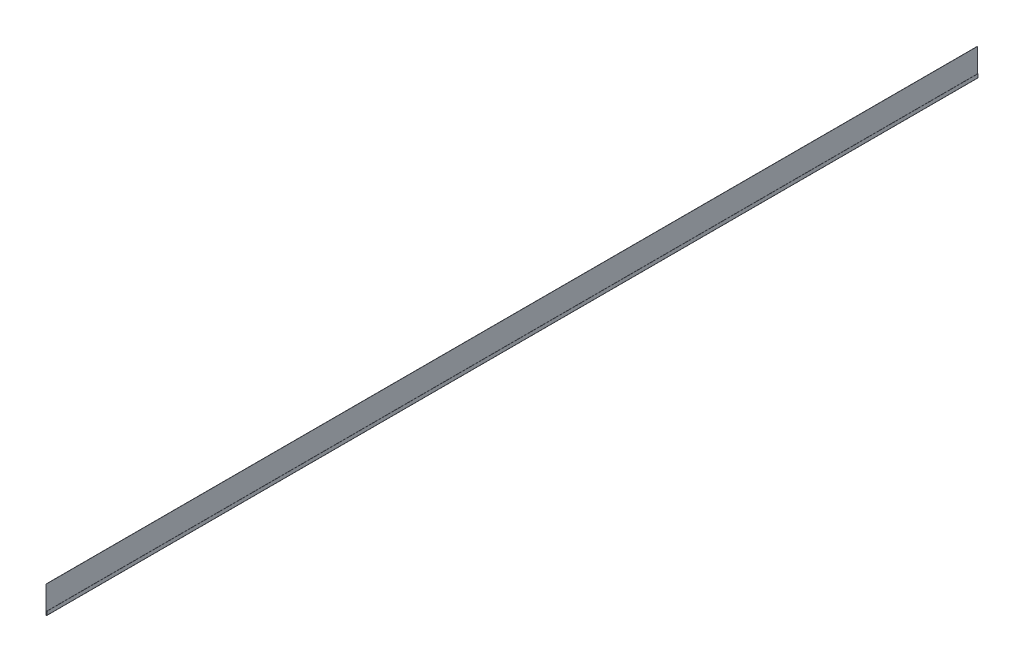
ISO-10303-21;
HEADER;
FILE_DESCRIPTION(('STEP AP214'),'2;1');
FILE_NAME('part.step','',(''),(''),'','','');
FILE_SCHEMA(('AUTOMOTIVE_DESIGN { 1 0 10303 214 1 1 1 1 }'));
ENDSEC;
DATA;
#1=APPLICATION_CONTEXT('core data for automotive mechanical design processes');
#2=APPLICATION_PROTOCOL_DEFINITION('international standard','automotive_design',2000,#1);
#3=PRODUCT_CONTEXT('',#1,'mechanical');
#4=PRODUCT('Part','Part','',(#3));
#5=PRODUCT_RELATED_PRODUCT_CATEGORY('part','',(#4));
#6=PRODUCT_DEFINITION_FORMATION('','',#4);
#7=PRODUCT_DEFINITION_CONTEXT('part definition',#1,'design');
#8=PRODUCT_DEFINITION('design','',#6,#7);
#9=PRODUCT_DEFINITION_SHAPE('','',#8);
#10=(LENGTH_UNIT() NAMED_UNIT(*) SI_UNIT(.MILLI.,.METRE.));
#11=(NAMED_UNIT(*) PLANE_ANGLE_UNIT() SI_UNIT($,.RADIAN.));
#12=(NAMED_UNIT(*) SI_UNIT($,.STERADIAN.) SOLID_ANGLE_UNIT());
#13=UNCERTAINTY_MEASURE_WITH_UNIT(LENGTH_MEASURE(1.E-05),#10,'distance_accuracy_value','');
#14=(GEOMETRIC_REPRESENTATION_CONTEXT(3) GLOBAL_UNCERTAINTY_ASSIGNED_CONTEXT((#13)) GLOBAL_UNIT_ASSIGNED_CONTEXT((#10,
#11,#12)) REPRESENTATION_CONTEXT('',''));
#15=CARTESIAN_POINT('',(0.,0.,0.));
#16=DIRECTION('',(0.,0.,1.));
#17=DIRECTION('',(1.,0.,0.));
#18=AXIS2_PLACEMENT_3D('',#15,#16,#17);
#19=CARTESIAN_POINT('',(2.54,1.27,3048.));
#20=DIRECTION('',(-1.,0.,0.));
#21=DIRECTION('',(0.,0.,1.));
#22=AXIS2_PLACEMENT_3D('',#19,#20,#21);
#23=PLANE('',#22);
#24=DIRECTION('',(0.,1.,0.));
#25=VECTOR('',#24,1.);
#26=CARTESIAN_POINT('',(2.54,1.27,0.));
#27=LINE('',#26,#25);
#28=CARTESIAN_POINT('',(2.54,1.27,0.));
#29=VERTEX_POINT('',#28);
#30=CARTESIAN_POINT('',(2.54,12.7,0.));
#31=VERTEX_POINT('',#30);
#32=EDGE_CURVE('E142',#29,#31,#27,.T.);
#33=ORIENTED_EDGE('',*,*,#32,.T.);
#34=DIRECTION('',(0.,0.,-1.));
#35=VECTOR('',#34,1.);
#36=CARTESIAN_POINT('',(2.54,12.7,3048.));
#37=LINE('',#36,#35);
#38=CARTESIAN_POINT('',(2.54,12.7,3048.));
#39=VERTEX_POINT('',#38);
#40=EDGE_CURVE('E13',#39,#31,#37,.T.);
#41=ORIENTED_EDGE('',*,*,#40,.F.);
#42=DIRECTION('',(0.,1.,0.));
#43=VECTOR('',#42,1.);
#44=CARTESIAN_POINT('',(2.54,1.27,3048.));
#45=LINE('',#44,#43);
#46=CARTESIAN_POINT('',(2.54,1.27,3048.));
#47=VERTEX_POINT('',#46);
#48=EDGE_CURVE('E100',#47,#39,#45,.T.);
#49=ORIENTED_EDGE('',*,*,#48,.F.);
#50=DIRECTION('',(0.,0.,-1.));
#51=VECTOR('',#50,1.);
#52=CARTESIAN_POINT('',(2.54,1.27,3048.));
#53=LINE('',#52,#51);
#54=EDGE_CURVE('E141',#47,#29,#53,.T.);
#55=ORIENTED_EDGE('',*,*,#54,.T.);
#56=EDGE_LOOP('',(#33,#41,#49,#55));
#57=FACE_BOUND('',#56,.T.);
#58=ADVANCED_FACE('F45',(#57),#23,.F.);
#59=CARTESIAN_POINT('',(2.032,12.7,3048.));
#60=DIRECTION('',(0.,1.,0.));
#61=DIRECTION('',(0.,0.,1.));
#62=AXIS2_PLACEMENT_3D('',#59,#60,#61);
#63=PLANE('',#62);
#64=DIRECTION('',(1.,0.,0.));
#65=VECTOR('',#64,1.);
#66=CARTESIAN_POINT('',(2.032,12.7,0.));
#67=LINE('',#66,#65);
#68=CARTESIAN_POINT('',(2.032,12.7,0.));
#69=VERTEX_POINT('',#68);
#70=EDGE_CURVE('E145',#69,#31,#67,.T.);
#71=ORIENTED_EDGE('',*,*,#70,.F.);
#72=DIRECTION('',(0.,0.,-1.));
#73=VECTOR('',#72,1.);
#74=CARTESIAN_POINT('',(2.032,12.7,3048.));
#75=LINE('',#74,#73);
#76=CARTESIAN_POINT('',(2.032,12.7,3048.));
#77=VERTEX_POINT('',#76);
#78=EDGE_CURVE('E53',#77,#69,#75,.T.);
#79=ORIENTED_EDGE('',*,*,#78,.F.);
#80=DIRECTION('',(1.,0.,0.));
#81=VECTOR('',#80,1.);
#82=CARTESIAN_POINT('',(2.032,12.7,3048.));
#83=LINE('',#82,#81);
#84=EDGE_CURVE('E184',#77,#39,#83,.T.);
#85=ORIENTED_EDGE('',*,*,#84,.T.);
#86=ORIENTED_EDGE('',*,*,#40,.T.);
#87=EDGE_LOOP('',(#71,#79,#85,#86));
#88=FACE_BOUND('',#87,.T.);
#89=ADVANCED_FACE('F175',(#88),#63,.T.);
#90=CARTESIAN_POINT('',(2.032,1.27,3048.));
#91=DIRECTION('',(-1.,0.,0.));
#92=DIRECTION('',(0.,0.,1.));
#93=AXIS2_PLACEMENT_3D('',#90,#91,#92);
#94=PLANE('',#93);
#95=DIRECTION('',(0.,1.,0.));
#96=VECTOR('',#95,1.);
#97=CARTESIAN_POINT('',(2.032,1.27,0.));
#98=LINE('',#97,#96);
#99=CARTESIAN_POINT('',(2.032,1.27,0.));
#100=VERTEX_POINT('',#99);
#101=EDGE_CURVE('E148',#100,#69,#98,.T.);
#102=ORIENTED_EDGE('',*,*,#101,.F.);
#103=DIRECTION('',(0.,0.,-1.));
#104=VECTOR('',#103,1.);
#105=CARTESIAN_POINT('',(2.032,1.27,3048.));
#106=LINE('',#105,#104);
#107=CARTESIAN_POINT('',(2.032,1.27,3048.));
#108=VERTEX_POINT('',#107);
#109=EDGE_CURVE('E165',#108,#100,#106,.T.);
#110=ORIENTED_EDGE('',*,*,#109,.F.);
#111=DIRECTION('',(0.,1.,0.));
#112=VECTOR('',#111,1.);
#113=CARTESIAN_POINT('',(2.032,1.27,3048.));
#114=LINE('',#113,#112);
#115=EDGE_CURVE('E172',#108,#77,#114,.T.);
#116=ORIENTED_EDGE('',*,*,#115,.T.);
#117=ORIENTED_EDGE('',*,*,#78,.T.);
#118=EDGE_LOOP('',(#102,#110,#116,#117));
#119=FACE_BOUND('',#118,.T.);
#120=ADVANCED_FACE('F170',(#119),#94,.T.);
#121=CARTESIAN_POINT('',(1.27,1.27,3048.));
#122=DIRECTION('',(0.,0.,-1.));
#123=DIRECTION('',(-1.,0.,0.));
#124=AXIS2_PLACEMENT_3D('',#121,#122,#123);
#125=CYLINDRICAL_SURFACE('',#124,0.762);
#126=CARTESIAN_POINT('',(1.27,1.27,0.));
#127=DIRECTION('',(0.,0.,1.));
#128=DIRECTION('',(1.,0.,0.));
#129=AXIS2_PLACEMENT_3D('',#126,#127,#128);
#130=CIRCLE('',#129,0.762);
#131=CARTESIAN_POINT('',(0.508,1.27,0.));
#132=VERTEX_POINT('',#131);
#133=EDGE_CURVE('E151',#132,#100,#130,.T.);
#134=ORIENTED_EDGE('',*,*,#133,.F.);
#135=DIRECTION('',(0.,0.,-1.));
#136=VECTOR('',#135,1.);
#137=CARTESIAN_POINT('',(0.508,1.27,3048.));
#138=LINE('',#137,#136);
#139=CARTESIAN_POINT('',(0.508,1.27,3048.));
#140=VERTEX_POINT('',#139);
#141=EDGE_CURVE('E163',#140,#132,#138,.T.);
#142=ORIENTED_EDGE('',*,*,#141,.F.);
#143=CARTESIAN_POINT('',(1.27,1.27,3048.));
#144=DIRECTION('',(0.,0.,1.));
#145=DIRECTION('',(1.,0.,0.));
#146=AXIS2_PLACEMENT_3D('',#143,#144,#145);
#147=CIRCLE('',#146,0.762);
#148=EDGE_CURVE('E136',#140,#108,#147,.T.);
#149=ORIENTED_EDGE('',*,*,#148,.T.);
#150=ORIENTED_EDGE('',*,*,#109,.T.);
#151=EDGE_LOOP('',(#134,#142,#149,#150));
#152=FACE_BOUND('',#151,.T.);
#153=ADVANCED_FACE('F182',(#152),#125,.F.);
#154=CARTESIAN_POINT('',(0.508,1.27,3048.));
#155=DIRECTION('',(1.,0.,0.));
#156=DIRECTION('',(0.,0.,-1.));
#157=AXIS2_PLACEMENT_3D('',#154,#155,#156);
#158=PLANE('',#157);
#159=DIRECTION('',(0.,1.,0.));
#160=VECTOR('',#159,1.);
#161=CARTESIAN_POINT('',(0.508,1.27,0.));
#162=LINE('',#161,#160);
#163=CARTESIAN_POINT('',(0.508,88.9,0.));
#164=VERTEX_POINT('',#163);
#165=EDGE_CURVE('E154',#164,#132,#162,.F.);
#166=ORIENTED_EDGE('',*,*,#165,.F.);
#167=DIRECTION('',(0.,0.,-1.));
#168=VECTOR('',#167,1.);
#169=CARTESIAN_POINT('',(0.508,88.9,3048.));
#170=LINE('',#169,#168);
#171=CARTESIAN_POINT('',(0.508,88.9,3048.));
#172=VERTEX_POINT('',#171);
#173=EDGE_CURVE('E124',#172,#164,#170,.T.);
#174=ORIENTED_EDGE('',*,*,#173,.F.);
#175=DIRECTION('',(0.,1.,0.));
#176=VECTOR('',#175,1.);
#177=CARTESIAN_POINT('',(0.508,1.27,3048.));
#178=LINE('',#177,#176);
#179=EDGE_CURVE('E134',#172,#140,#178,.F.);
#180=ORIENTED_EDGE('',*,*,#179,.T.);
#181=ORIENTED_EDGE('',*,*,#141,.T.);
#182=EDGE_LOOP('',(#166,#174,#180,#181));
#183=FACE_BOUND('',#182,.T.);
#184=ADVANCED_FACE('F189',(#183),#158,.T.);
#185=CARTESIAN_POINT('',(0.,88.9,3048.));
#186=DIRECTION('',(0.,1.,0.));
#187=DIRECTION('',(0.,0.,1.));
#188=AXIS2_PLACEMENT_3D('',#185,#186,#187);
#189=PLANE('',#188);
#190=DIRECTION('',(1.,0.,0.));
#191=VECTOR('',#190,1.);
#192=CARTESIAN_POINT('',(0.,88.9,0.));
#193=LINE('',#192,#191);
#194=CARTESIAN_POINT('',(0.,88.9,0.));
#195=VERTEX_POINT('',#194);
#196=EDGE_CURVE('E123',#195,#164,#193,.T.);
#197=ORIENTED_EDGE('',*,*,#196,.F.);
#198=DIRECTION('',(0.,0.,-1.));
#199=VECTOR('',#198,1.);
#200=CARTESIAN_POINT('',(0.,88.9,3048.));
#201=LINE('',#200,#199);
#202=CARTESIAN_POINT('',(0.,88.9,3048.));
#203=VERTEX_POINT('',#202);
#204=EDGE_CURVE('E117',#203,#195,#201,.T.);
#205=ORIENTED_EDGE('',*,*,#204,.F.);
#206=DIRECTION('',(1.,0.,0.));
#207=VECTOR('',#206,1.);
#208=CARTESIAN_POINT('',(0.,88.9,3048.));
#209=LINE('',#208,#207);
#210=EDGE_CURVE('E121',#203,#172,#209,.T.);
#211=ORIENTED_EDGE('',*,*,#210,.T.);
#212=ORIENTED_EDGE('',*,*,#173,.T.);
#213=EDGE_LOOP('',(#197,#205,#211,#212));
#214=FACE_BOUND('',#213,.T.);
#215=ADVANCED_FACE('F119',(#214),#189,.T.);
#216=CARTESIAN_POINT('',(0.,1.27,3048.));
#217=DIRECTION('',(1.,0.,0.));
#218=DIRECTION('',(0.,0.,-1.));
#219=AXIS2_PLACEMENT_3D('',#216,#217,#218);
#220=PLANE('',#219);
#221=DIRECTION('',(0.,-1.,0.));
#222=VECTOR('',#221,1.);
#223=CARTESIAN_POINT('',(0.,1.27,0.));
#224=LINE('',#223,#222);
#225=CARTESIAN_POINT('',(0.,1.27,0.));
#226=VERTEX_POINT('',#225);
#227=EDGE_CURVE('E88',#195,#226,#224,.T.);
#228=ORIENTED_EDGE('',*,*,#227,.T.);
#229=DIRECTION('',(0.,0.,-1.));
#230=VECTOR('',#229,1.);
#231=CARTESIAN_POINT('',(0.,1.27,3048.));
#232=LINE('',#231,#230);
#233=CARTESIAN_POINT('',(0.,1.27,3048.));
#234=VERTEX_POINT('',#233);
#235=EDGE_CURVE('E125',#234,#226,#232,.T.);
#236=ORIENTED_EDGE('',*,*,#235,.F.);
#237=DIRECTION('',(0.,-1.,0.));
#238=VECTOR('',#237,1.);
#239=CARTESIAN_POINT('',(0.,1.27,3048.));
#240=LINE('',#239,#238);
#241=EDGE_CURVE('E127',#203,#234,#240,.T.);
#242=ORIENTED_EDGE('',*,*,#241,.F.);
#243=ORIENTED_EDGE('',*,*,#204,.T.);
#244=EDGE_LOOP('',(#228,#236,#242,#243));
#245=FACE_BOUND('',#244,.T.);
#246=ADVANCED_FACE('F128',(#245),#220,.F.);
#247=CARTESIAN_POINT('',(1.27,1.27,3048.));
#248=DIRECTION('',(0.,0.,-1.));
#249=DIRECTION('',(-1.,0.,0.));
#250=AXIS2_PLACEMENT_3D('',#247,#248,#249);
#251=CYLINDRICAL_SURFACE('',#250,1.27);
#252=CARTESIAN_POINT('',(1.27,1.27,0.));
#253=DIRECTION('',(0.,0.,1.));
#254=DIRECTION('',(1.,0.,0.));
#255=AXIS2_PLACEMENT_3D('',#252,#253,#254);
#256=CIRCLE('',#255,1.27);
#257=EDGE_CURVE('E94',#226,#29,#256,.T.);
#258=ORIENTED_EDGE('',*,*,#257,.T.);
#259=ORIENTED_EDGE('',*,*,#54,.F.);
#260=CARTESIAN_POINT('',(1.27,1.27,3048.));
#261=DIRECTION('',(0.,0.,1.));
#262=DIRECTION('',(1.,0.,0.));
#263=AXIS2_PLACEMENT_3D('',#260,#261,#262);
#264=CIRCLE('',#263,1.27);
#265=EDGE_CURVE('E61',#234,#47,#264,.T.);
#266=ORIENTED_EDGE('',*,*,#265,.F.);
#267=ORIENTED_EDGE('',*,*,#235,.T.);
#268=EDGE_LOOP('',(#258,#259,#266,#267));
#269=FACE_BOUND('',#268,.T.);
#270=ADVANCED_FACE('F191',(#269),#251,.T.);
#271=CARTESIAN_POINT('',(1.27,1.27,3048.));
#272=DIRECTION('',(0.,0.,1.));
#273=DIRECTION('',(1.,0.,0.));
#274=AXIS2_PLACEMENT_3D('',#271,#272,#273);
#275=PLANE('',#274);
#276=ORIENTED_EDGE('',*,*,#48,.T.);
#277=ORIENTED_EDGE('',*,*,#84,.F.);
#278=ORIENTED_EDGE('',*,*,#115,.F.);
#279=ORIENTED_EDGE('',*,*,#148,.F.);
#280=ORIENTED_EDGE('',*,*,#179,.F.);
#281=ORIENTED_EDGE('',*,*,#210,.F.);
#282=ORIENTED_EDGE('',*,*,#241,.T.);
#283=ORIENTED_EDGE('',*,*,#265,.T.);
#284=EDGE_LOOP('',(#276,#277,#278,#279,#280,#281,#282,#283));
#285=FACE_BOUND('',#284,.T.);
#286=ADVANCED_FACE('F131',(#285),#275,.T.);
#287=CARTESIAN_POINT('',(1.27,1.27,0.));
#288=DIRECTION('',(0.,0.,1.));
#289=DIRECTION('',(1.,0.,0.));
#290=AXIS2_PLACEMENT_3D('',#287,#288,#289);
#291=PLANE('',#290);
#292=ORIENTED_EDGE('',*,*,#32,.F.);
#293=ORIENTED_EDGE('',*,*,#257,.F.);
#294=ORIENTED_EDGE('',*,*,#227,.F.);
#295=ORIENTED_EDGE('',*,*,#196,.T.);
#296=ORIENTED_EDGE('',*,*,#165,.T.);
#297=ORIENTED_EDGE('',*,*,#133,.T.);
#298=ORIENTED_EDGE('',*,*,#101,.T.);
#299=ORIENTED_EDGE('',*,*,#70,.T.);
#300=EDGE_LOOP('',(#292,#293,#294,#295,#296,#297,#298,#299));
#301=FACE_BOUND('',#300,.T.);
#302=ADVANCED_FACE('F178',(#301),#291,.F.);
#303=CLOSED_SHELL('',(#58,#89,#120,#153,#184,#215,#246,#270,#286,#302));
#304=MANIFOLD_SOLID_BREP('B2',#303);
#305=ADVANCED_BREP_SHAPE_REPRESENTATION('',(#18,#304),#14);
#306=SHAPE_DEFINITION_REPRESENTATION(#9,#305);
ENDSEC;
END-ISO-10303-21;
